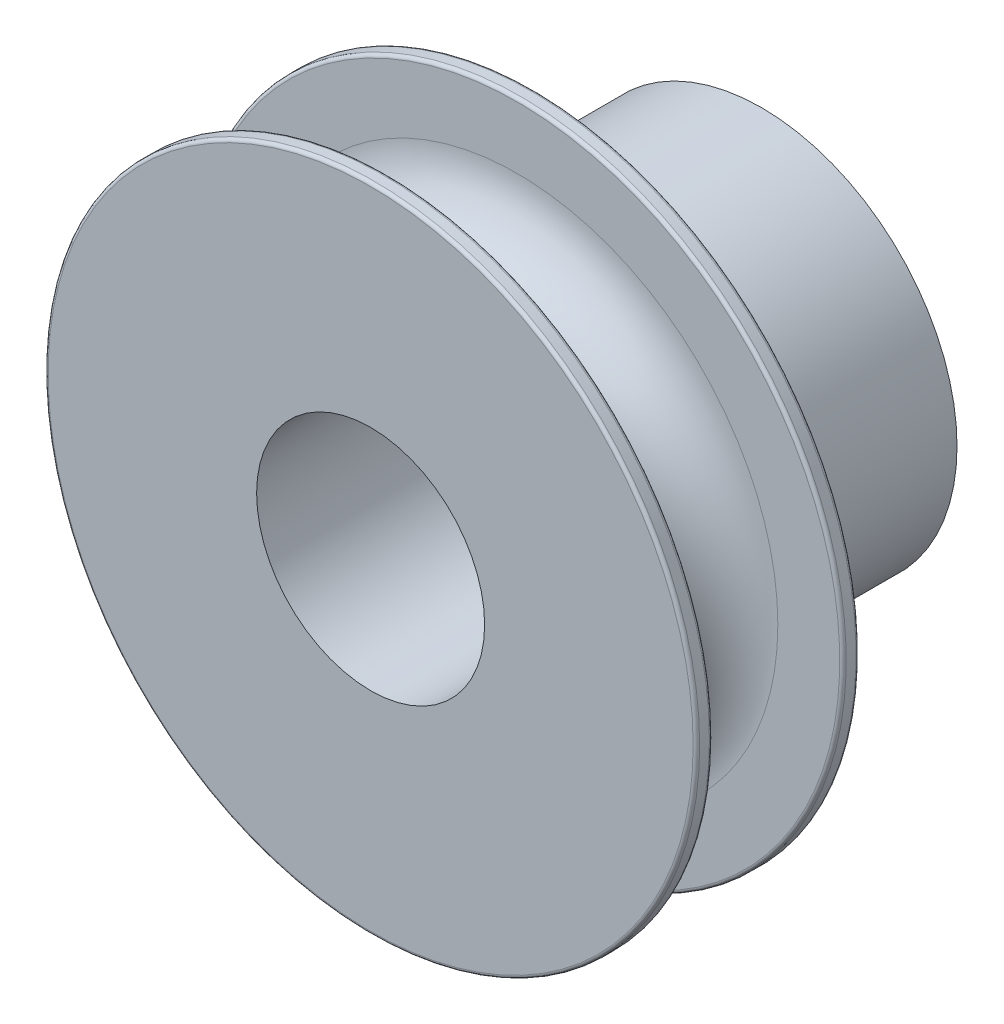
ISO-10303-21;
HEADER;
FILE_DESCRIPTION(('STEP AP214'),'2;1');
FILE_NAME('part.step','',(''),(''),'','','');
FILE_SCHEMA(('AUTOMOTIVE_DESIGN { 1 0 10303 214 1 1 1 1 }'));
ENDSEC;
DATA;
#1=APPLICATION_CONTEXT('core data for automotive mechanical design processes');
#2=APPLICATION_PROTOCOL_DEFINITION('international standard','automotive_design',2000,#1);
#3=PRODUCT_CONTEXT('',#1,'mechanical');
#4=PRODUCT('Part','Part','',(#3));
#5=PRODUCT_RELATED_PRODUCT_CATEGORY('part','',(#4));
#6=PRODUCT_DEFINITION_FORMATION('','',#4);
#7=PRODUCT_DEFINITION_CONTEXT('part definition',#1,'design');
#8=PRODUCT_DEFINITION('design','',#6,#7);
#9=PRODUCT_DEFINITION_SHAPE('','',#8);
#10=(LENGTH_UNIT() NAMED_UNIT(*) SI_UNIT(.MILLI.,.METRE.));
#11=(NAMED_UNIT(*) PLANE_ANGLE_UNIT() SI_UNIT($,.RADIAN.));
#12=(NAMED_UNIT(*) SI_UNIT($,.STERADIAN.) SOLID_ANGLE_UNIT());
#13=UNCERTAINTY_MEASURE_WITH_UNIT(LENGTH_MEASURE(1.E-05),#10,'distance_accuracy_value','');
#14=(GEOMETRIC_REPRESENTATION_CONTEXT(3) GLOBAL_UNCERTAINTY_ASSIGNED_CONTEXT((#13)) GLOBAL_UNIT_ASSIGNED_CONTEXT((#10,
#11,#12)) REPRESENTATION_CONTEXT('',''));
#15=CARTESIAN_POINT('',(0.,0.,0.));
#16=DIRECTION('',(0.,0.,1.));
#17=DIRECTION('',(1.,0.,0.));
#18=AXIS2_PLACEMENT_3D('',#15,#16,#17);
#19=CARTESIAN_POINT('',(0.,0.,-101.6));
#20=DIRECTION('',(0.,0.,1.));
#21=DIRECTION('',(1.,0.,0.));
#22=AXIS2_PLACEMENT_3D('',#19,#20,#21);
#23=CYLINDRICAL_SURFACE('',#22,38.1);
#24=CARTESIAN_POINT('',(0.,0.,-69.85));
#25=DIRECTION('',(0.,0.,-1.));
#26=DIRECTION('',(-1.,0.,0.));
#27=AXIS2_PLACEMENT_3D('',#24,#25,#26);
#28=CIRCLE('',#27,38.1);
#29=CARTESIAN_POINT('',(38.1,0.,-69.85));
#30=VERTEX_POINT('',#29);
#31=EDGE_CURVE('E78',#30,#30,#28,.T.);
#32=CARTESIAN_POINT('',(0.,0.,-101.6));
#33=DIRECTION('',(0.,0.,1.));
#34=DIRECTION('',(1.,0.,0.));
#35=AXIS2_PLACEMENT_3D('',#32,#33,#34);
#36=CIRCLE('',#35,38.1);
#37=CARTESIAN_POINT('',(38.1,0.,-101.6));
#38=VERTEX_POINT('',#37);
#39=EDGE_CURVE('E87',#38,#38,#36,.T.);
#40=CARTESIAN_POINT('',(38.1,0.,-69.85));
#41=CARTESIAN_POINT('',(38.1,0.,-70.1807291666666));
#42=CARTESIAN_POINT('',(38.1,0.,-70.5114583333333));
#43=CARTESIAN_POINT('',(38.1,0.,-71.1729166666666));
#44=CARTESIAN_POINT('',(38.1,0.,-71.5036458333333));
#45=CARTESIAN_POINT('',(38.1,0.,-72.1651041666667));
#46=CARTESIAN_POINT('',(38.1,0.,-72.4958333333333));
#47=CARTESIAN_POINT('',(38.1,0.,-73.1572916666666));
#48=CARTESIAN_POINT('',(38.1,0.,-73.4880208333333));
#49=CARTESIAN_POINT('',(38.1,0.,-74.1494791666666));
#50=CARTESIAN_POINT('',(38.1,0.,-74.4802083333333));
#51=CARTESIAN_POINT('',(38.1,0.,-75.1416666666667));
#52=CARTESIAN_POINT('',(38.1,0.,-75.4723958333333));
#53=CARTESIAN_POINT('',(38.1,0.,-76.1338541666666));
#54=CARTESIAN_POINT('',(38.1,0.,-76.4645833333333));
#55=CARTESIAN_POINT('',(38.1,0.,-77.1260416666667));
#56=CARTESIAN_POINT('',(38.1,0.,-77.4567708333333));
#57=CARTESIAN_POINT('',(38.1,0.,-78.1182291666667));
#58=CARTESIAN_POINT('',(38.1,0.,-78.4489583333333));
#59=CARTESIAN_POINT('',(38.1,0.,-79.1104166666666));
#60=CARTESIAN_POINT('',(38.1,0.,-79.4411458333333));
#61=CARTESIAN_POINT('',(38.1,0.,-80.1026041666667));
#62=CARTESIAN_POINT('',(38.1,0.,-80.4333333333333));
#63=CARTESIAN_POINT('',(38.1,0.,-81.0947916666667));
#64=CARTESIAN_POINT('',(38.1,0.,-81.4255208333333));
#65=CARTESIAN_POINT('',(38.1,0.,-82.0869791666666));
#66=CARTESIAN_POINT('',(38.1,0.,-82.4177083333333));
#67=CARTESIAN_POINT('',(38.1,0.,-83.0791666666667));
#68=CARTESIAN_POINT('',(38.1,0.,-83.4098958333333));
#69=CARTESIAN_POINT('',(38.1,0.,-84.0713541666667));
#70=CARTESIAN_POINT('',(38.1,0.,-84.4020833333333));
#71=CARTESIAN_POINT('',(38.1,0.,-85.0635416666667));
#72=CARTESIAN_POINT('',(38.1,0.,-85.3942708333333));
#73=CARTESIAN_POINT('',(38.1,0.,-86.0557291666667));
#74=CARTESIAN_POINT('',(38.1,0.,-86.3864583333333));
#75=CARTESIAN_POINT('',(38.1,0.,-87.0479166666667));
#76=CARTESIAN_POINT('',(38.1,0.,-87.3786458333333));
#77=CARTESIAN_POINT('',(38.1,0.,-88.0401041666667));
#78=CARTESIAN_POINT('',(38.1,0.,-88.3708333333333));
#79=CARTESIAN_POINT('',(38.1,0.,-89.0322916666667));
#80=CARTESIAN_POINT('',(38.1,0.,-89.3630208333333));
#81=CARTESIAN_POINT('',(38.1,0.,-90.0244791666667));
#82=CARTESIAN_POINT('',(38.1,0.,-90.3552083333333));
#83=CARTESIAN_POINT('',(38.1,0.,-91.0166666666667));
#84=CARTESIAN_POINT('',(38.1,0.,-91.3473958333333));
#85=CARTESIAN_POINT('',(38.1,0.,-92.0088541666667));
#86=CARTESIAN_POINT('',(38.1,0.,-92.3395833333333));
#87=CARTESIAN_POINT('',(38.1,0.,-93.0010416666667));
#88=CARTESIAN_POINT('',(38.1,0.,-93.3317708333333));
#89=CARTESIAN_POINT('',(38.1,0.,-93.9932291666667));
#90=CARTESIAN_POINT('',(38.1,0.,-94.3239583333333));
#91=CARTESIAN_POINT('',(38.1,0.,-94.9854166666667));
#92=CARTESIAN_POINT('',(38.1,0.,-95.3161458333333));
#93=CARTESIAN_POINT('',(38.1,0.,-95.9776041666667));
#94=CARTESIAN_POINT('',(38.1,0.,-96.3083333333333));
#95=CARTESIAN_POINT('',(38.1,0.,-96.9697916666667));
#96=CARTESIAN_POINT('',(38.1,0.,-97.3005208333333));
#97=CARTESIAN_POINT('',(38.1,0.,-97.9619791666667));
#98=CARTESIAN_POINT('',(38.1,0.,-98.2927083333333));
#99=CARTESIAN_POINT('',(38.1,0.,-98.9541666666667));
#100=CARTESIAN_POINT('',(38.1,0.,-99.2848958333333));
#101=CARTESIAN_POINT('',(38.1,0.,-99.9463541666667));
#102=CARTESIAN_POINT('',(38.1,0.,-100.277083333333));
#103=CARTESIAN_POINT('',(38.1,0.,-100.938541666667));
#104=CARTESIAN_POINT('',(38.1,0.,-101.269270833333));
#105=CARTESIAN_POINT('',(38.1,0.,-101.6));
#106=B_SPLINE_CURVE_WITH_KNOTS('',3,(#40,#41,#42,#43,#44,#45,#46,#47,#48,#49,#50,#51,#52,#53,
#54,#55,#56,#57,#58,#59,#60,#61,#62,#63,#64,#65,#66,#67,#68,#69,#70,#71,#72,#73,#74,#75,#76,#77,
#78,#79,#80,#81,#82,#83,#84,#85,#86,#87,#88,#89,#90,#91,#92,#93,#94,#95,#96,#97,#98,#99,#100,
#101,#102,#103,#104,#105),.UNSPECIFIED.,.F.,.F.,(4,2,2,2,2,2,2,2,2,2,2,2,2,2,2,2,2,2,2,2,2,2,2,
2,2,2,2,2,2,2,2,2,4),(0.,0.992187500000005,1.98437500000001,2.9765625,3.96875000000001,
4.96093750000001,5.953125,6.94531250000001,7.93750000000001,8.92968750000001,9.92187500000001,
10.9140625,11.90625,12.8984375,13.890625,14.8828125,15.875,16.8671875,17.859375,18.8515625,
19.84375,20.8359375,21.828125,22.8203125,23.8125,24.8046875,25.796875,26.7890625,27.78125,
28.7734375,29.765625,30.7578125,31.75),.UNSPECIFIED.);
#107=EDGE_CURVE('BSEAM39',#30,#38,#106,.T.);
#108=ORIENTED_EDGE('',*,*,#31,.T.);
#109=ORIENTED_EDGE('',*,*,#39,.T.);
#110=ORIENTED_EDGE('',*,*,#107,.T.);
#111=ORIENTED_EDGE('',*,*,#107,.F.);
#112=EDGE_LOOP('',(#108,#110,#109,#111));
#113=FACE_BOUND('',#112,.T.);
#114=ADVANCED_FACE('F39',(#113),#23,.T.);
#115=CARTESIAN_POINT('',(0.,0.,-101.6));
#116=DIRECTION('',(0.,0.,1.));
#117=DIRECTION('',(1.,0.,0.));
#118=AXIS2_PLACEMENT_3D('',#115,#116,#117);
#119=PLANE('',#118);
#120=CARTESIAN_POINT('',(0.,0.,-101.6));
#121=DIRECTION('',(0.,0.,1.));
#122=DIRECTION('',(1.,0.,0.));
#123=AXIS2_PLACEMENT_3D('',#120,#121,#122);
#124=CIRCLE('',#123,22.225);
#125=CARTESIAN_POINT('',(22.225,0.,-101.6));
#126=VERTEX_POINT('',#125);
#127=EDGE_CURVE('E90',#126,#126,#124,.T.);
#128=ORIENTED_EDGE('',*,*,#127,.T.);
#129=EDGE_LOOP('',(#128));
#130=FACE_BOUND('',#129,.T.);
#131=ORIENTED_EDGE('',*,*,#39,.F.);
#132=EDGE_LOOP('',(#131));
#133=FACE_BOUND('',#132,.T.);
#134=ADVANCED_FACE('F96',(#130,#133),#119,.F.);
#135=CARTESIAN_POINT('',(0.,0.,-25.4));
#136=DIRECTION('',(0.,0.,1.));
#137=DIRECTION('',(1.,0.,0.));
#138=AXIS2_PLACEMENT_3D('',#135,#136,#137);
#139=PLANE('',#138);
#140=CARTESIAN_POINT('',(0.,0.,-25.4));
#141=DIRECTION('',(0.,0.,1.));
#142=DIRECTION('',(1.,0.,0.));
#143=AXIS2_PLACEMENT_3D('',#140,#141,#142);
#144=CIRCLE('',#143,62.865);
#145=CARTESIAN_POINT('',(62.865,0.,-25.4));
#146=VERTEX_POINT('',#145);
#147=EDGE_CURVE('E10',#146,#146,#144,.T.);
#148=ORIENTED_EDGE('',*,*,#147,.T.);
#149=EDGE_LOOP('',(#148));
#150=FACE_BOUND('',#149,.T.);
#151=CARTESIAN_POINT('',(0.,0.,-25.4));
#152=DIRECTION('',(0.,0.,1.));
#153=DIRECTION('',(1.,0.,0.));
#154=AXIS2_PLACEMENT_3D('',#151,#152,#153);
#155=CIRCLE('',#154,22.225);
#156=CARTESIAN_POINT('',(22.225,0.,-25.4));
#157=VERTEX_POINT('',#156);
#158=EDGE_CURVE('E75',#157,#157,#155,.T.);
#159=ORIENTED_EDGE('',*,*,#158,.F.);
#160=EDGE_LOOP('',(#159));
#161=FACE_BOUND('',#160,.T.);
#162=ADVANCED_FACE('F103',(#150,#161),#139,.T.);
#163=CARTESIAN_POINT('',(0.,0.,-101.6));
#164=DIRECTION('',(0.,0.,1.));
#165=DIRECTION('',(1.,0.,0.));
#166=AXIS2_PLACEMENT_3D('',#163,#164,#165);
#167=CYLINDRICAL_SURFACE('',#166,22.225);
#168=CARTESIAN_POINT('',(22.225,0.,-101.6));
#169=CARTESIAN_POINT('',(22.225,0.,-100.80625));
#170=CARTESIAN_POINT('',(22.225,0.,-100.0125));
#171=CARTESIAN_POINT('',(22.225,0.,-98.425));
#172=CARTESIAN_POINT('',(22.225,0.,-97.63125));
#173=CARTESIAN_POINT('',(22.225,0.,-96.04375));
#174=CARTESIAN_POINT('',(22.225,0.,-95.25));
#175=CARTESIAN_POINT('',(22.225,0.,-93.6625));
#176=CARTESIAN_POINT('',(22.225,0.,-92.86875));
#177=CARTESIAN_POINT('',(22.225,0.,-91.28125));
#178=CARTESIAN_POINT('',(22.225,0.,-90.4875));
#179=CARTESIAN_POINT('',(22.225,0.,-88.9));
#180=CARTESIAN_POINT('',(22.225,0.,-88.10625));
#181=CARTESIAN_POINT('',(22.225,0.,-86.51875));
#182=CARTESIAN_POINT('',(22.225,0.,-85.725));
#183=CARTESIAN_POINT('',(22.225,0.,-84.1375));
#184=CARTESIAN_POINT('',(22.225,0.,-83.34375));
#185=CARTESIAN_POINT('',(22.225,0.,-81.75625));
#186=CARTESIAN_POINT('',(22.225,0.,-80.9625));
#187=CARTESIAN_POINT('',(22.225,0.,-79.375));
#188=CARTESIAN_POINT('',(22.225,0.,-78.58125));
#189=CARTESIAN_POINT('',(22.225,0.,-76.99375));
#190=CARTESIAN_POINT('',(22.225,0.,-76.2));
#191=CARTESIAN_POINT('',(22.225,0.,-74.6125));
#192=CARTESIAN_POINT('',(22.225,0.,-73.81875));
#193=CARTESIAN_POINT('',(22.225,0.,-72.23125));
#194=CARTESIAN_POINT('',(22.225,0.,-71.4375));
#195=CARTESIAN_POINT('',(22.225,0.,-69.85));
#196=CARTESIAN_POINT('',(22.225,0.,-69.05625));
#197=CARTESIAN_POINT('',(22.225,0.,-67.46875));
#198=CARTESIAN_POINT('',(22.225,0.,-66.675));
#199=CARTESIAN_POINT('',(22.225,0.,-65.0875));
#200=CARTESIAN_POINT('',(22.225,0.,-64.29375));
#201=CARTESIAN_POINT('',(22.225,0.,-62.70625));
#202=CARTESIAN_POINT('',(22.225,0.,-61.9125));
#203=CARTESIAN_POINT('',(22.225,0.,-60.325));
#204=CARTESIAN_POINT('',(22.225,0.,-59.53125));
#205=CARTESIAN_POINT('',(22.225,0.,-57.94375));
#206=CARTESIAN_POINT('',(22.225,0.,-57.15));
#207=CARTESIAN_POINT('',(22.225,0.,-55.5625));
#208=CARTESIAN_POINT('',(22.225,0.,-54.76875));
#209=CARTESIAN_POINT('',(22.225,0.,-53.18125));
#210=CARTESIAN_POINT('',(22.225,0.,-52.3875));
#211=CARTESIAN_POINT('',(22.225,0.,-50.8));
#212=CARTESIAN_POINT('',(22.225,0.,-50.00625));
#213=CARTESIAN_POINT('',(22.225,0.,-48.41875));
#214=CARTESIAN_POINT('',(22.225,0.,-47.625));
#215=CARTESIAN_POINT('',(22.225,0.,-46.0375));
#216=CARTESIAN_POINT('',(22.225,0.,-45.24375));
#217=CARTESIAN_POINT('',(22.225,0.,-43.65625));
#218=CARTESIAN_POINT('',(22.225,0.,-42.8625));
#219=CARTESIAN_POINT('',(22.225,0.,-41.275));
#220=CARTESIAN_POINT('',(22.225,0.,-40.48125));
#221=CARTESIAN_POINT('',(22.225,0.,-38.89375));
#222=CARTESIAN_POINT('',(22.225,0.,-38.1));
#223=CARTESIAN_POINT('',(22.225,0.,-36.5125));
#224=CARTESIAN_POINT('',(22.225,0.,-35.71875));
#225=CARTESIAN_POINT('',(22.225,0.,-34.13125));
#226=CARTESIAN_POINT('',(22.225,0.,-33.3375));
#227=CARTESIAN_POINT('',(22.225,0.,-31.75));
#228=CARTESIAN_POINT('',(22.225,0.,-30.95625));
#229=CARTESIAN_POINT('',(22.225,0.,-29.36875));
#230=CARTESIAN_POINT('',(22.225,0.,-28.575));
#231=CARTESIAN_POINT('',(22.225,0.,-26.9875));
#232=CARTESIAN_POINT('',(22.225,0.,-26.19375));
#233=CARTESIAN_POINT('',(22.225,0.,-25.4));
#234=B_SPLINE_CURVE_WITH_KNOTS('',3,(#168,#169,#170,#171,#172,#173,#174,#175,#176,#177,#178,
#179,#180,#181,#182,#183,#184,#185,#186,#187,#188,#189,#190,#191,#192,#193,#194,#195,#196,#197,
#198,#199,#200,#201,#202,#203,#204,#205,#206,#207,#208,#209,#210,#211,#212,#213,#214,#215,#216,
#217,#218,#219,#220,#221,#222,#223,#224,#225,#226,#227,#228,#229,#230,#231,#232,#233),
.UNSPECIFIED.,.F.,.F.,(4,2,2,2,2,2,2,2,2,2,2,2,2,2,2,2,2,2,2,2,2,2,2,2,2,2,2,2,2,2,2,2,4),(0.,
2.38125,4.7625,7.14375,9.52500000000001,11.90625,14.2875,16.66875,19.05,21.43125,23.8125,
26.19375,28.575,30.95625,33.3375,35.71875,38.1,40.48125,42.8625,45.24375,47.625,50.00625,
52.3875,54.76875,57.15,59.53125,61.9125,64.29375,66.675,69.05625,71.4375,73.81875,76.2),.UNSPECIFIED.);
#235=EDGE_CURVE('BSEAM99',#126,#157,#234,.T.);
#236=ORIENTED_EDGE('',*,*,#127,.F.);
#237=ORIENTED_EDGE('',*,*,#158,.T.);
#238=ORIENTED_EDGE('',*,*,#235,.T.);
#239=ORIENTED_EDGE('',*,*,#235,.F.);
#240=EDGE_LOOP('',(#236,#238,#237,#239));
#241=FACE_BOUND('',#240,.T.);
#242=ADVANCED_FACE('F99',(#241),#167,.F.);
#243=CARTESIAN_POINT('',(0.,0.,-28.575));
#244=DIRECTION('',(0.,0.,1.));
#245=DIRECTION('',(1.,0.,0.));
#246=AXIS2_PLACEMENT_3D('',#243,#244,#245);
#247=CYLINDRICAL_SURFACE('',#246,63.5);
#248=CARTESIAN_POINT('',(0.,0.,-27.94));
#249=DIRECTION('',(0.,0.,1.));
#250=DIRECTION('',(1.,0.,0.));
#251=AXIS2_PLACEMENT_3D('',#248,#249,#250);
#252=CIRCLE('',#251,63.5);
#253=CARTESIAN_POINT('',(63.5,0.,-27.94));
#254=VERTEX_POINT('',#253);
#255=EDGE_CURVE('E65',#254,#254,#252,.T.);
#256=ORIENTED_EDGE('',*,*,#255,.T.);
#257=EDGE_LOOP('',(#256));
#258=FACE_BOUND('',#257,.T.);
#259=CARTESIAN_POINT('',(0.,0.,-26.035));
#260=DIRECTION('',(0.,0.,1.));
#261=DIRECTION('',(1.,0.,0.));
#262=AXIS2_PLACEMENT_3D('',#259,#260,#261);
#263=CIRCLE('',#262,63.5);
#264=CARTESIAN_POINT('',(63.5,0.,-26.035));
#265=VERTEX_POINT('',#264);
#266=EDGE_CURVE('E68',#265,#265,#263,.F.);
#267=ORIENTED_EDGE('',*,*,#266,.T.);
#268=EDGE_LOOP('',(#267));
#269=FACE_BOUND('',#268,.T.);
#270=ADVANCED_FACE('F102',(#258,#269),#247,.T.);
#271=CARTESIAN_POINT('',(0.,0.,-28.575));
#272=DIRECTION('',(0.,0.,1.));
#273=DIRECTION('',(1.,0.,0.));
#274=AXIS2_PLACEMENT_3D('',#271,#272,#273);
#275=PLANE('',#274);
#276=CARTESIAN_POINT('',(0.,0.,-28.575));
#277=DIRECTION('',(0.,0.,1.));
#278=DIRECTION('',(1.,0.,0.));
#279=AXIS2_PLACEMENT_3D('',#276,#277,#278);
#280=CIRCLE('',#279,62.865);
#281=CARTESIAN_POINT('',(62.865,0.,-28.575));
#282=VERTEX_POINT('',#281);
#283=EDGE_CURVE('E62',#282,#282,#280,.F.);
#284=ORIENTED_EDGE('',*,*,#283,.T.);
#285=EDGE_LOOP('',(#284));
#286=FACE_BOUND('',#285,.T.);
#287=CARTESIAN_POINT('',(0.,0.,-28.575));
#288=DIRECTION('',(0.,0.,1.));
#289=DIRECTION('',(1.,0.,0.));
#290=AXIS2_PLACEMENT_3D('',#287,#288,#289);
#291=CIRCLE('',#290,50.8);
#292=CARTESIAN_POINT('',(50.8,0.,-28.575));
#293=VERTEX_POINT('',#292);
#294=EDGE_CURVE('E71',#293,#293,#291,.T.);
#295=ORIENTED_EDGE('',*,*,#294,.T.);
#296=EDGE_LOOP('',(#295));
#297=FACE_BOUND('',#296,.T.);
#298=ADVANCED_FACE('F162',(#286,#297),#275,.F.);
#299=CARTESIAN_POINT('',(0.,0.,-53.975));
#300=DIRECTION('',(0.,0.,-1.));
#301=DIRECTION('',(1.,0.,0.));
#302=AXIS2_PLACEMENT_3D('',#299,#300,#301);
#303=PLANE('',#302);
#304=CARTESIAN_POINT('',(0.,0.,-53.975));
#305=DIRECTION('',(0.,0.,-1.));
#306=DIRECTION('',(-1.,0.,0.));
#307=AXIS2_PLACEMENT_3D('',#304,#305,#306);
#308=CIRCLE('',#307,62.865);
#309=CARTESIAN_POINT('',(-62.865,0.,-53.975));
#310=VERTEX_POINT('',#309);
#311=EDGE_CURVE('E59',#310,#310,#308,.F.);
#312=ORIENTED_EDGE('',*,*,#311,.T.);
#313=EDGE_LOOP('',(#312));
#314=FACE_BOUND('',#313,.T.);
#315=CARTESIAN_POINT('',(0.,0.,-53.975));
#316=DIRECTION('',(0.,0.,-1.));
#317=DIRECTION('',(-1.,0.,0.));
#318=AXIS2_PLACEMENT_3D('',#315,#316,#317);
#319=CIRCLE('',#318,50.8);
#320=CARTESIAN_POINT('',(-50.8,0.,-53.975));
#321=VERTEX_POINT('',#320);
#322=EDGE_CURVE('E84',#321,#321,#319,.T.);
#323=ORIENTED_EDGE('',*,*,#322,.T.);
#324=EDGE_LOOP('',(#323));
#325=FACE_BOUND('',#324,.T.);
#326=ADVANCED_FACE('F158',(#314,#325),#303,.F.);
#327=CARTESIAN_POINT('',(0.,0.,-57.15));
#328=DIRECTION('',(0.,0.,-1.));
#329=DIRECTION('',(1.,0.,0.));
#330=AXIS2_PLACEMENT_3D('',#327,#328,#329);
#331=PLANE('',#330);
#332=CARTESIAN_POINT('',(0.,0.,-57.15));
#333=DIRECTION('',(0.,0.,-1.));
#334=DIRECTION('',(-1.,0.,0.));
#335=AXIS2_PLACEMENT_3D('',#332,#333,#334);
#336=CIRCLE('',#335,62.865);
#337=CARTESIAN_POINT('',(-62.865,0.,-57.15));
#338=VERTEX_POINT('',#337);
#339=EDGE_CURVE('E46',#338,#338,#336,.T.);
#340=ORIENTED_EDGE('',*,*,#339,.T.);
#341=EDGE_LOOP('',(#340));
#342=FACE_BOUND('',#341,.T.);
#343=CARTESIAN_POINT('',(0.,0.,-57.15));
#344=DIRECTION('',(0.,0.,-1.));
#345=DIRECTION('',(-1.,0.,0.));
#346=AXIS2_PLACEMENT_3D('',#343,#344,#345);
#347=CIRCLE('',#346,50.8);
#348=CARTESIAN_POINT('',(-50.8,0.,-57.15));
#349=VERTEX_POINT('',#348);
#350=EDGE_CURVE('E81',#349,#349,#347,.F.);
#351=ORIENTED_EDGE('',*,*,#350,.T.);
#352=EDGE_LOOP('',(#351));
#353=FACE_BOUND('',#352,.T.);
#354=ADVANCED_FACE('F152',(#342,#353),#331,.T.);
#355=CARTESIAN_POINT('',(0.,0.,-53.975));
#356=DIRECTION('',(0.,0.,-1.));
#357=DIRECTION('',(-1.,0.,0.));
#358=AXIS2_PLACEMENT_3D('',#355,#356,#357);
#359=CYLINDRICAL_SURFACE('',#358,63.5);
#360=CARTESIAN_POINT('',(0.,0.,-54.61));
#361=DIRECTION('',(0.,0.,-1.));
#362=DIRECTION('',(-1.,0.,0.));
#363=AXIS2_PLACEMENT_3D('',#360,#361,#362);
#364=CIRCLE('',#363,63.5);
#365=CARTESIAN_POINT('',(-63.5,0.,-54.61));
#366=VERTEX_POINT('',#365);
#367=EDGE_CURVE('E50',#366,#366,#364,.T.);
#368=ORIENTED_EDGE('',*,*,#367,.T.);
#369=EDGE_LOOP('',(#368));
#370=FACE_BOUND('',#369,.T.);
#371=CARTESIAN_POINT('',(0.,0.,-56.515));
#372=DIRECTION('',(0.,0.,-1.));
#373=DIRECTION('',(-1.,0.,0.));
#374=AXIS2_PLACEMENT_3D('',#371,#372,#373);
#375=CIRCLE('',#374,63.5);
#376=CARTESIAN_POINT('',(-63.5,0.,-56.515));
#377=VERTEX_POINT('',#376);
#378=EDGE_CURVE('E54',#377,#377,#375,.F.);
#379=ORIENTED_EDGE('',*,*,#378,.T.);
#380=EDGE_LOOP('',(#379));
#381=FACE_BOUND('',#380,.T.);
#382=ADVANCED_FACE('F130',(#370,#381),#359,.T.);
#383=CARTESIAN_POINT('',(0.,0.,-41.275));
#384=DIRECTION('',(0.,0.,1.));
#385=DIRECTION('',(1.,0.,0.));
#386=AXIS2_PLACEMENT_3D('',#383,#384,#385);
#387=TOROIDAL_SURFACE('',#386,50.8,12.7);
#388=ORIENTED_EDGE('',*,*,#294,.F.);
#389=EDGE_LOOP('',(#388));
#390=FACE_BOUND('',#389,.T.);
#391=CARTESIAN_POINT('',(0.,0.,-41.275));
#392=DIRECTION('',(0.,0.,1.));
#393=DIRECTION('',(1.,0.,0.));
#394=AXIS2_PLACEMENT_3D('',#391,#392,#393);
#395=CIRCLE('',#394,38.1);
#396=CARTESIAN_POINT('',(38.1,0.,-41.275));
#397=VERTEX_POINT('',#396);
#398=EDGE_CURVE('E72',#397,#397,#395,.F.);
#399=ORIENTED_EDGE('',*,*,#398,.F.);
#400=EDGE_LOOP('',(#399));
#401=FACE_BOUND('',#400,.T.);
#402=ADVANCED_FACE('F127',(#390,#401),#387,.F.);
#403=CARTESIAN_POINT('',(0.,0.,-41.275));
#404=DIRECTION('',(0.,0.,-1.));
#405=DIRECTION('',(-1.,0.,0.));
#406=AXIS2_PLACEMENT_3D('',#403,#404,#405);
#407=TOROIDAL_SURFACE('',#406,50.8,12.7);
#408=ORIENTED_EDGE('',*,*,#322,.F.);
#409=EDGE_LOOP('',(#408));
#410=FACE_BOUND('',#409,.T.);
#411=ORIENTED_EDGE('',*,*,#398,.T.);
#412=EDGE_LOOP('',(#411));
#413=FACE_BOUND('',#412,.T.);
#414=ADVANCED_FACE('F123',(#410,#413),#407,.F.);
#415=CARTESIAN_POINT('',(0.,0.,-69.85));
#416=DIRECTION('',(0.,0.,-1.));
#417=DIRECTION('',(-1.,0.,0.));
#418=AXIS2_PLACEMENT_3D('',#415,#416,#417);
#419=TOROIDAL_SURFACE('',#418,50.8,12.7);
#420=ORIENTED_EDGE('',*,*,#31,.F.);
#421=EDGE_LOOP('',(#420));
#422=FACE_BOUND('',#421,.T.);
#423=ORIENTED_EDGE('',*,*,#350,.F.);
#424=EDGE_LOOP('',(#423));
#425=FACE_BOUND('',#424,.T.);
#426=ADVANCED_FACE('F126',(#422,#425),#419,.F.);
#427=CARTESIAN_POINT('',(0.,0.,-27.94));
#428=DIRECTION('',(0.,0.,1.));
#429=DIRECTION('',(1.,0.,0.));
#430=AXIS2_PLACEMENT_3D('',#427,#428,#429);
#431=TOROIDAL_SURFACE('',#430,62.865,0.635);
#432=ORIENTED_EDGE('',*,*,#283,.F.);
#433=EDGE_LOOP('',(#432));
#434=FACE_BOUND('',#433,.T.);
#435=ORIENTED_EDGE('',*,*,#255,.F.);
#436=EDGE_LOOP('',(#435));
#437=FACE_BOUND('',#436,.T.);
#438=ADVANCED_FACE('F133',(#434,#437),#431,.T.);
#439=CARTESIAN_POINT('',(0.,0.,-54.61));
#440=DIRECTION('',(0.,0.,-1.));
#441=DIRECTION('',(-1.,0.,0.));
#442=AXIS2_PLACEMENT_3D('',#439,#440,#441);
#443=TOROIDAL_SURFACE('',#442,62.865,0.635);
#444=ORIENTED_EDGE('',*,*,#367,.F.);
#445=EDGE_LOOP('',(#444));
#446=FACE_BOUND('',#445,.T.);
#447=ORIENTED_EDGE('',*,*,#311,.F.);
#448=EDGE_LOOP('',(#447));
#449=FACE_BOUND('',#448,.T.);
#450=ADVANCED_FACE('F137',(#446,#449),#443,.T.);
#451=CARTESIAN_POINT('',(0.,0.,-56.515));
#452=DIRECTION('',(0.,0.,-1.));
#453=DIRECTION('',(-1.,0.,0.));
#454=AXIS2_PLACEMENT_3D('',#451,#452,#453);
#455=TOROIDAL_SURFACE('',#454,62.865,0.635);
#456=ORIENTED_EDGE('',*,*,#339,.F.);
#457=EDGE_LOOP('',(#456));
#458=FACE_BOUND('',#457,.T.);
#459=ORIENTED_EDGE('',*,*,#378,.F.);
#460=EDGE_LOOP('',(#459));
#461=FACE_BOUND('',#460,.T.);
#462=ADVANCED_FACE('F140',(#458,#461),#455,.T.);
#463=CARTESIAN_POINT('',(0.,0.,-26.035));
#464=DIRECTION('',(0.,0.,1.));
#465=DIRECTION('',(1.,0.,0.));
#466=AXIS2_PLACEMENT_3D('',#463,#464,#465);
#467=TOROIDAL_SURFACE('',#466,62.865,0.635);
#468=ORIENTED_EDGE('',*,*,#266,.F.);
#469=EDGE_LOOP('',(#468));
#470=FACE_BOUND('',#469,.T.);
#471=ORIENTED_EDGE('',*,*,#147,.F.);
#472=EDGE_LOOP('',(#471));
#473=FACE_BOUND('',#472,.T.);
#474=ADVANCED_FACE('F41',(#470,#473),#467,.T.);
#475=CLOSED_SHELL('',(#114,#134,#162,#242,#270,#298,#326,#354,#382,#402,#414,#426,#438,#450,
#462,#474));
#476=MANIFOLD_SOLID_BREP('B2',#475);
#477=ADVANCED_BREP_SHAPE_REPRESENTATION('',(#18,#476),#14);
#478=SHAPE_DEFINITION_REPRESENTATION(#9,#477);
ENDSEC;
END-ISO-10303-21;
